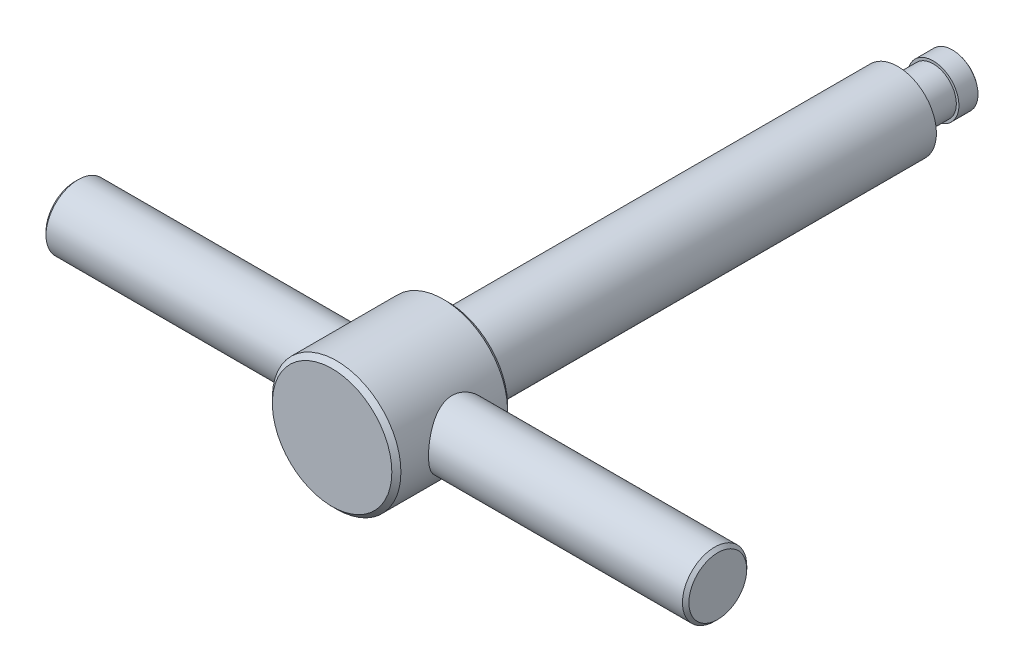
ISO-10303-21;
HEADER;
FILE_DESCRIPTION(('STEP AP214'),'2;1');
FILE_NAME('part.step','',(''),(''),'','','');
FILE_SCHEMA(('AUTOMOTIVE_DESIGN { 1 0 10303 214 1 1 1 1 }'));
ENDSEC;
DATA;
#1=APPLICATION_CONTEXT('core data for automotive mechanical design processes');
#2=APPLICATION_PROTOCOL_DEFINITION('international standard','automotive_design',2000,#1);
#3=PRODUCT_CONTEXT('',#1,'mechanical');
#4=PRODUCT('Part','Part','',(#3));
#5=PRODUCT_RELATED_PRODUCT_CATEGORY('part','',(#4));
#6=PRODUCT_DEFINITION_FORMATION('','',#4);
#7=PRODUCT_DEFINITION_CONTEXT('part definition',#1,'design');
#8=PRODUCT_DEFINITION('design','',#6,#7);
#9=PRODUCT_DEFINITION_SHAPE('','',#8);
#10=(LENGTH_UNIT() NAMED_UNIT(*) SI_UNIT(.MILLI.,.METRE.));
#11=(NAMED_UNIT(*) PLANE_ANGLE_UNIT() SI_UNIT($,.RADIAN.));
#12=(NAMED_UNIT(*) SI_UNIT($,.STERADIAN.) SOLID_ANGLE_UNIT());
#13=UNCERTAINTY_MEASURE_WITH_UNIT(LENGTH_MEASURE(1.E-05),#10,'distance_accuracy_value','');
#14=(GEOMETRIC_REPRESENTATION_CONTEXT(3) GLOBAL_UNCERTAINTY_ASSIGNED_CONTEXT((#13)) GLOBAL_UNIT_ASSIGNED_CONTEXT((#10,
#11,#12)) REPRESENTATION_CONTEXT('',''));
#15=CARTESIAN_POINT('',(0.,0.,0.));
#16=DIRECTION('',(0.,0.,1.));
#17=DIRECTION('',(1.,0.,0.));
#18=AXIS2_PLACEMENT_3D('',#15,#16,#17);
#19=CARTESIAN_POINT('',(50.,0.,92.5));
#20=DIRECTION('',(-1.,0.,0.));
#21=DIRECTION('',(0.,-1.,0.));
#22=AXIS2_PLACEMENT_3D('',#19,#20,#21);
#23=PLANE('',#22);
#24=CARTESIAN_POINT('',(50.0000000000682,0.,88.));
#25=DIRECTION('',(-1.,0.,0.));
#26=DIRECTION('',(0.,0.,-1.));
#27=AXIS2_PLACEMENT_3D('',#24,#25,#26);
#28=CIRCLE('',#27,4.49999999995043);
#29=CARTESIAN_POINT('',(50.0000000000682,0.,83.5000000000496));
#30=VERTEX_POINT('',#29);
#31=EDGE_CURVE('E15',#30,#30,#28,.T.);
#32=ORIENTED_EDGE('',*,*,#31,.F.);
#33=EDGE_LOOP('',(#32));
#34=FACE_BOUND('',#33,.T.);
#35=ADVANCED_FACE('F12',(#34),#23,.F.);
#36=CARTESIAN_POINT('',(-50.,0.,88.));
#37=DIRECTION('',(1.,0.,0.));
#38=DIRECTION('',(0.,1.,0.));
#39=AXIS2_PLACEMENT_3D('',#36,#37,#38);
#40=PLANE('',#39);
#41=CARTESIAN_POINT('',(-50.0000000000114,0.,88.));
#42=DIRECTION('',(1.,0.,0.));
#43=DIRECTION('',(0.,1.,0.));
#44=AXIS2_PLACEMENT_3D('',#41,#42,#43);
#45=CIRCLE('',#44,4.50000000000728);
#46=CARTESIAN_POINT('',(-50.0000000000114,4.50000000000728,88.));
#47=VERTEX_POINT('',#46);
#48=EDGE_CURVE('E133',#47,#47,#45,.T.);
#49=ORIENTED_EDGE('',*,*,#48,.F.);
#50=EDGE_LOOP('',(#49));
#51=FACE_BOUND('',#50,.T.);
#52=ADVANCED_FACE('F171',(#51),#40,.F.);
#53=CARTESIAN_POINT('',(0.,0.,6.));
#54=DIRECTION('',(-1.,0.,0.));
#55=DIRECTION('',(0.,1.,0.));
#56=AXIS2_PLACEMENT_3D('',#53,#54,#55);
#57=SPHERICAL_SURFACE('',#56,6.);
#58=CARTESIAN_POINT('',(0.,0.,1.52786404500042));
#59=DIRECTION('',(0.,0.,1.));
#60=DIRECTION('',(0.,-1.,0.));
#61=AXIS2_PLACEMENT_3D('',#58,#59,#60);
#62=CIRCLE('',#61,4.);
#63=CARTESIAN_POINT('',(0.,-4.,1.52786404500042));
#64=VERTEX_POINT('',#63);
#65=EDGE_CURVE('E126',#64,#64,#62,.T.);
#66=ORIENTED_EDGE('',*,*,#65,.F.);
#67=EDGE_LOOP('',(#66));
#68=FACE_BOUND('',#67,.T.);
#69=ADVANCED_FACE('F168',(#68),#57,.T.);
#70=CARTESIAN_POINT('',(49.5000000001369,0.,88.));
#71=DIRECTION('',(-1.,0.,0.));
#72=DIRECTION('',(0.,0.,-1.));
#73=AXIS2_PLACEMENT_3D('',#70,#71,#72);
#74=CONICAL_SURFACE('',#73,4.99999999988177,0.785398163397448);
#75=CARTESIAN_POINT('',(49.5,0.,88.));
#76=DIRECTION('',(-1.,0.,0.));
#77=DIRECTION('',(0.,-1.,0.));
#78=AXIS2_PLACEMENT_3D('',#75,#76,#77);
#79=CIRCLE('',#78,5.);
#80=CARTESIAN_POINT('',(49.5,-5.,88.));
#81=VERTEX_POINT('',#80);
#82=EDGE_CURVE('E124',#81,#81,#79,.T.);
#83=ORIENTED_EDGE('',*,*,#82,.F.);
#84=EDGE_LOOP('',(#83));
#85=FACE_BOUND('',#84,.T.);
#86=ORIENTED_EDGE('',*,*,#31,.T.);
#87=EDGE_LOOP('',(#86));
#88=FACE_BOUND('',#87,.T.);
#89=ADVANCED_FACE('F164',(#85,#88),#74,.T.);
#90=CARTESIAN_POINT('',(0.,0.,98.));
#91=DIRECTION('',(0.,0.,-1.));
#92=DIRECTION('',(0.,1.,0.));
#93=AXIS2_PLACEMENT_3D('',#90,#91,#92);
#94=PLANE('',#93);
#95=CARTESIAN_POINT('',(0.,0.,98.));
#96=DIRECTION('',(0.,0.,-1.));
#97=DIRECTION('',(1.,0.,0.));
#98=AXIS2_PLACEMENT_3D('',#95,#96,#97);
#99=CIRCLE('',#98,9.29289321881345);
#100=CARTESIAN_POINT('',(9.29289321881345,0.,98.));
#101=VERTEX_POINT('',#100);
#102=EDGE_CURVE('E121',#101,#101,#99,.T.);
#103=ORIENTED_EDGE('',*,*,#102,.F.);
#104=EDGE_LOOP('',(#103));
#105=FACE_BOUND('',#104,.T.);
#106=ADVANCED_FACE('F160',(#105),#94,.F.);
#107=CARTESIAN_POINT('',(-49.5000000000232,0.,88.));
#108=DIRECTION('',(1.,0.,0.));
#109=DIRECTION('',(0.,1.,0.));
#110=AXIS2_PLACEMENT_3D('',#107,#108,#109);
#111=CONICAL_SURFACE('',#110,4.99999999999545,0.785398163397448);
#112=ORIENTED_EDGE('',*,*,#48,.T.);
#113=EDGE_LOOP('',(#112));
#114=FACE_BOUND('',#113,.T.);
#115=CARTESIAN_POINT('',(-49.5,0.,88.));
#116=DIRECTION('',(-1.,0.,0.));
#117=DIRECTION('',(0.,-1.,0.));
#118=AXIS2_PLACEMENT_3D('',#115,#116,#117);
#119=CIRCLE('',#118,5.);
#120=CARTESIAN_POINT('',(-49.5,-5.,88.));
#121=VERTEX_POINT('',#120);
#122=EDGE_CURVE('E117',#121,#121,#119,.F.);
#123=ORIENTED_EDGE('',*,*,#122,.F.);
#124=EDGE_LOOP('',(#123));
#125=FACE_BOUND('',#124,.T.);
#126=ADVANCED_FACE('F154',(#114,#125),#111,.T.);
#127=CARTESIAN_POINT('',(0.,0.,0.));
#128=DIRECTION('',(0.,0.,1.));
#129=DIRECTION('',(0.,-1.,0.));
#130=AXIS2_PLACEMENT_3D('',#127,#128,#129);
#131=CYLINDRICAL_SURFACE('',#130,4.);
#132=CARTESIAN_POINT('',(0.,0.,4.5));
#133=DIRECTION('',(0.,0.,1.));
#134=DIRECTION('',(0.,-1.,0.));
#135=AXIS2_PLACEMENT_3D('',#132,#133,#134);
#136=CIRCLE('',#135,4.);
#137=CARTESIAN_POINT('',(0.,-4.,4.5));
#138=VERTEX_POINT('',#137);
#139=EDGE_CURVE('E120',#138,#138,#136,.F.);
#140=ORIENTED_EDGE('',*,*,#139,.T.);
#141=EDGE_LOOP('',(#140));
#142=FACE_BOUND('',#141,.T.);
#143=ORIENTED_EDGE('',*,*,#65,.T.);
#144=EDGE_LOOP('',(#143));
#145=FACE_BOUND('',#144,.T.);
#146=ADVANCED_FACE('F147',(#142,#145),#131,.T.);
#147=CARTESIAN_POINT('',(50.,0.,88.));
#148=DIRECTION('',(-1.,0.,0.));
#149=DIRECTION('',(0.,-1.,0.));
#150=AXIS2_PLACEMENT_3D('',#147,#148,#149);
#151=CYLINDRICAL_SURFACE('',#150,5.);
#152=CARTESIAN_POINT('',(8.6639413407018,4.9936079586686,87.7472559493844));
#153=CARTESIAN_POINT('',(8.6678034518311,4.98690821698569,87.6149033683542));
#154=CARTESIAN_POINT('',(8.6746945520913,4.97494418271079,87.4828866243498));
#155=CARTESIAN_POINT('',(8.69427133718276,4.94065080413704,87.2205887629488));
#156=CARTESIAN_POINT('',(8.70696013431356,4.91831589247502,87.090308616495));
#157=CARTESIAN_POINT('',(8.73768503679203,4.86352211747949,86.8322782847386));
#158=CARTESIAN_POINT('',(8.75573112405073,4.8310443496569,86.7045333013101));
#159=CARTESIAN_POINT('',(8.79651985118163,4.75636852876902,86.4526662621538));
#160=CARTESIAN_POINT('',(8.81926458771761,4.71416613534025,86.3285458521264));
#161=CARTESIAN_POINT('',(8.89313906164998,4.57418822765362,85.9643002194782));
#162=CARTESIAN_POINT('',(8.95014013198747,4.4626532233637,85.7304943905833));
#163=CARTESIAN_POINT('',(9.07337097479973,4.20643250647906,85.2848338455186));
#164=CARTESIAN_POINT('',(9.13960025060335,4.06174857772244,85.072977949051));
#165=CARTESIAN_POINT('',(9.28089281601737,3.72835184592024,84.6568680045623));
#166=CARTESIAN_POINT('',(9.35622221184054,3.53689559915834,84.4548979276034));
#167=CARTESIAN_POINT('',(9.50269094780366,3.12203782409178,84.0846325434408));
#168=CARTESIAN_POINT('',(9.57382865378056,2.89862395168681,83.9163503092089));
#169=CARTESIAN_POINT('',(9.67330415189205,2.53843331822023,83.6898233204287));
#170=CARTESIAN_POINT('',(9.7058122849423,2.41146244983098,83.6174994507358));
#171=CARTESIAN_POINT('',(9.7668501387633,2.15092926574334,83.4839286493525));
#172=CARTESIAN_POINT('',(9.79538157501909,2.01736982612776,83.4226769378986));
#173=CARTESIAN_POINT('',(9.84761864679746,1.74461665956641,83.3119327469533));
#174=CARTESIAN_POINT('',(9.87132625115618,1.60542525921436,83.2624354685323));
#175=CARTESIAN_POINT('',(9.91320308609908,1.32244067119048,83.1757863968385));
#176=CARTESIAN_POINT('',(9.9313729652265,1.17864802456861,83.1386331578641));
#177=CARTESIAN_POINT('',(9.96027993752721,0.900367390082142,83.0798607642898));
#178=CARTESIAN_POINT('',(9.97152591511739,0.766157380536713,83.0571718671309));
#179=CARTESIAN_POINT('',(9.98860845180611,0.495997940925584,83.022799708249));
#180=CARTESIAN_POINT('',(9.9944454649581,0.360048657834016,83.0111155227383));
#181=CARTESIAN_POINT('',(10.0005447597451,0.0875738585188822,82.9989077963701));
#182=CARTESIAN_POINT('',(10.0008090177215,-0.0489514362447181,82.9983802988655));
#183=CARTESIAN_POINT('',(9.99576016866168,-0.321481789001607,83.0084830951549));
#184=CARTESIAN_POINT('',(9.99044726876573,-0.45748686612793,83.0191129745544));
#185=CARTESIAN_POINT('',(9.97498362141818,-0.717956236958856,83.0502056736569));
#186=CARTESIAN_POINT('',(9.96521520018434,-0.842536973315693,83.0698923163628));
#187=CARTESIAN_POINT('',(9.94124846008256,-1.08948387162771,83.1185178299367));
#188=CARTESIAN_POINT('',(9.92704873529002,-1.21184931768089,83.1474596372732));
#189=CARTESIAN_POINT('',(9.89455126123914,-1.45351624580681,83.2142922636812));
#190=CARTESIAN_POINT('',(9.87625470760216,-1.57281861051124,83.2521804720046));
#191=CARTESIAN_POINT('',(9.83597398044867,-1.80771983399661,83.3365518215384));
#192=CARTESIAN_POINT('',(9.81398839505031,-1.92331725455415,83.3830382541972));
#193=CARTESIAN_POINT('',(9.74156802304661,-2.27136199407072,83.5382972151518));
#194=CARTESIAN_POINT('',(9.6858132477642,-2.49684688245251,83.6605947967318));
#195=CARTESIAN_POINT('',(9.56530778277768,-2.92480777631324,83.9366877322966));
#196=CARTESIAN_POINT('',(9.50055298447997,-3.12727319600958,84.0904974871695));
#197=CARTESIAN_POINT('',(9.36078921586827,-3.52480596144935,84.4428786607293));
#198=CARTESIAN_POINT('',(9.28540002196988,-3.7171514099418,84.6443755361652));
#199=CARTESIAN_POINT('',(9.13782606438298,-4.06646861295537,85.0774671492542));
#200=CARTESIAN_POINT('',(9.06564336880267,-4.22341779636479,85.3090809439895));
#201=CARTESIAN_POINT('',(8.96466251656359,-4.43183231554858,85.6804757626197));
#202=CARTESIAN_POINT('',(8.93163700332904,-4.49782747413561,85.8111425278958));
#203=CARTESIAN_POINT('',(8.86988749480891,-4.61840670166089,86.0785929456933));
#204=CARTESIAN_POINT('',(8.84116149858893,-4.67299608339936,86.2153737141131));
#205=CARTESIAN_POINT('',(8.78915478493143,-4.77009386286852,86.494025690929));
#206=CARTESIAN_POINT('',(8.76586925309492,-4.81261294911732,86.6358922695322));
#207=CARTESIAN_POINT('',(8.72571734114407,-4.88503616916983,86.9236976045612));
#208=CARTESIAN_POINT('',(8.70884993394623,-4.91494232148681,87.0696357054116));
#209=CARTESIAN_POINT('',(8.68367597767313,-4.95926907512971,87.3491683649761));
#210=CARTESIAN_POINT('',(8.67467052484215,-4.97496023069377,87.4824995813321));
#211=CARTESIAN_POINT('',(8.66282228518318,-4.99556348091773,87.7502606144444));
#212=CARTESIAN_POINT('',(8.65997890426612,-5.00047661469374,87.8846903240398));
#213=CARTESIAN_POINT('',(8.66057117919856,-4.99945062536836,88.1534566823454));
#214=CARTESIAN_POINT('',(8.66400516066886,-4.99351439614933,88.2877933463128));
#215=CARTESIAN_POINT('',(8.6770076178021,-4.97088602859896,88.5552512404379));
#216=CARTESIAN_POINT('',(8.68657590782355,-4.95419421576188,88.6883725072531));
#217=CARTESIAN_POINT('',(8.71036385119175,-4.91223841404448,88.9406294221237));
#218=CARTESIAN_POINT('',(8.72409695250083,-4.88786373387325,89.0599602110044));
#219=CARTESIAN_POINT('',(8.75590671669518,-4.83064807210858,89.2959957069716));
#220=CARTESIAN_POINT('',(8.77398472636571,-4.79780446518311,89.4126995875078));
#221=CARTESIAN_POINT('',(8.83395755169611,-4.68703534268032,89.7578390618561));
#222=CARTESIAN_POINT('',(8.88160721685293,-4.59684472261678,89.9814608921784));
#223=CARTESIAN_POINT('',(8.99125967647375,-4.37871621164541,90.4275802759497));
#224=CARTESIAN_POINT('',(9.05407323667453,-4.24844682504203,90.6487244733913));
#225=CARTESIAN_POINT('',(9.18532801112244,-3.95668828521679,91.0675468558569));
#226=CARTESIAN_POINT('',(9.25377257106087,-3.79518049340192,91.2652109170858));
#227=CARTESIAN_POINT('',(9.39832077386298,-3.42284387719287,91.6558446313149));
#228=CARTESIAN_POINT('',(9.47436862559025,-3.20843552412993,91.8454686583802));
#229=CARTESIAN_POINT('',(9.58193181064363,-2.86376988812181,92.1011420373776));
#230=CARTESIAN_POINT('',(9.61672131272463,-2.74495698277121,92.1816143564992));
#231=CARTESIAN_POINT('',(9.68322432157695,-2.50024068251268,92.3323683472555));
#232=CARTESIAN_POINT('',(9.71493926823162,-2.37434065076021,92.4026547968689));
#233=CARTESIAN_POINT('',(9.77437128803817,-2.11640250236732,92.5322892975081));
#234=CARTESIAN_POINT('',(9.80209494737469,-1.98437498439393,92.591655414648));
#235=CARTESIAN_POINT('',(9.85280649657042,-1.71492890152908,92.6989393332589));
#236=CARTESIAN_POINT('',(9.875796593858,-1.57751288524,92.7468624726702));
#237=CARTESIAN_POINT('',(9.91635831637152,-1.29835291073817,92.8306839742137));
#238=CARTESIAN_POINT('',(9.93393271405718,-1.15661120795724,92.8665884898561));
#239=CARTESIAN_POINT('',(9.96312961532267,-0.86994021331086,92.9259131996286));
#240=CARTESIAN_POINT('',(9.97475279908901,-0.725011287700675,92.949334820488));
#241=CARTESIAN_POINT('',(9.99083813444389,-0.447757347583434,92.9816683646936));
#242=CARTESIAN_POINT('',(9.99589570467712,-0.315606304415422,92.9917879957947));
#243=CARTESIAN_POINT('',(10.0007472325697,-0.0508240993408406,93.0014961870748));
#244=CARTESIAN_POINT('',(10.000541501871,0.0818070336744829,93.0010853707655));
#245=CARTESIAN_POINT('',(9.99487225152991,0.346478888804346,92.9897389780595));
#246=CARTESIAN_POINT('',(9.989409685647,0.478519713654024,92.9788053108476));
#247=CARTESIAN_POINT('',(9.97337445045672,0.741008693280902,92.9465536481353));
#248=CARTESIAN_POINT('',(9.962801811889,0.871456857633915,92.9252357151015));
#249=CARTESIAN_POINT('',(9.93743452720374,1.12369515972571,92.8737135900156));
#250=CARTESIAN_POINT('',(9.9228627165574,1.24560333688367,92.8439763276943));
#251=CARTESIAN_POINT('',(9.88966974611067,1.48634787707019,92.7756100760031));
#252=CARTESIAN_POINT('',(9.87104728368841,1.60518323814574,92.7369782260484));
#253=CARTESIAN_POINT('',(9.80970869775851,1.95595951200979,92.6082690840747));
#254=CARTESIAN_POINT('',(9.76150048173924,2.18236866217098,92.5053371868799));
#255=CARTESIAN_POINT('',(9.6512451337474,2.6286090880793,92.2613458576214));
#256=CARTESIAN_POINT('',(9.58853528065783,2.84720551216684,92.1183503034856));
#257=CARTESIAN_POINT('',(9.45668808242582,3.25848585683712,91.8012792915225));
#258=CARTESIAN_POINT('',(9.38754708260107,3.45115488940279,91.6271861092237));
#259=CARTESIAN_POINT('',(9.24208671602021,3.82463320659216,91.23310217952));
#260=CARTESIAN_POINT('',(9.1657245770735,4.00245580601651,91.0102916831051));
#261=CARTESIAN_POINT('',(9.02097056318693,4.31884937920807,90.5355067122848));
#262=CARTESIAN_POINT('',(8.95258327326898,4.45739783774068,90.2835156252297));
#263=CARTESIAN_POINT('',(8.86265475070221,4.63224192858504,89.8876796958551));
#264=CARTESIAN_POINT('',(8.83473366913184,4.68511709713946,89.7524000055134));
#265=CARTESIAN_POINT('',(8.78424027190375,4.77911859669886,89.4768789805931));
#266=CARTESIAN_POINT('',(8.76166504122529,4.82025133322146,89.336640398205));
#267=CARTESIAN_POINT('',(8.72286222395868,4.8901197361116,89.0526469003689));
#268=CARTESIAN_POINT('',(8.70661815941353,4.91888760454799,88.9089021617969));
#269=CARTESIAN_POINT('',(8.68114164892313,4.96371371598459,88.6189038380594));
#270=CARTESIAN_POINT('',(8.67190422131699,4.97978098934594,88.4726521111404));
#271=CARTESIAN_POINT('',(8.66276238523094,4.99565691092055,88.2296234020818));
#272=CARTESIAN_POINT('',(8.66073972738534,4.99915860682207,88.1331479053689));
#273=CARTESIAN_POINT('',(8.65992340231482,5.00057282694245,87.9401409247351));
#274=CARTESIAN_POINT('',(8.66112970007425,4.9984854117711,87.8436094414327));
#275=CARTESIAN_POINT('',(8.6639413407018,4.9936079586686,87.7472559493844));
#276=B_SPLINE_CURVE_WITH_KNOTS('',3,(#152,#153,#154,#155,#156,#157,#158,#159,#160,#161,#162,
#163,#164,#165,#166,#167,#168,#169,#170,#171,#172,#173,#174,#175,#176,#177,#178,#179,#180,#181,
#182,#183,#184,#185,#186,#187,#188,#189,#190,#191,#192,#193,#194,#195,#196,#197,#198,#199,#200,
#201,#202,#203,#204,#205,#206,#207,#208,#209,#210,#211,#212,#213,#214,#215,#216,#217,#218,#219,
#220,#221,#222,#223,#224,#225,#226,#227,#228,#229,#230,#231,#232,#233,#234,#235,#236,#237,#238,
#239,#240,#241,#242,#243,#244,#245,#246,#247,#248,#249,#250,#251,#252,#253,#254,#255,#256,#257,
#258,#259,#260,#261,#262,#263,#264,#265,#266,#267,#268,#269,#270,#271,#272,#273,#274,#275),
.UNSPECIFIED.,.T.,.F.,(4,2,2,2,2,2,2,2,2,2,2,2,2,2,2,2,2,2,2,2,2,2,2,2,2,2,2,2,2,2,2,2,2,2,2,2,
2,2,2,2,2,2,2,2,2,2,2,2,2,2,2,2,2,2,2,2,2,2,2,2,2,4),(0.,0.397631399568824,0.795476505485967,
1.19406759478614,1.59283693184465,2.38488811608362,3.17689668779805,4.03814904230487,
4.89973497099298,5.3483186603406,5.7967082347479,6.24491443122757,6.69306811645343,
7.10225762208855,7.51141277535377,7.92042282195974,8.32941767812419,8.70849392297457,
9.08769056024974,9.4667766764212,9.84600821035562,10.6299816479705,11.4143141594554,
12.2763801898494,13.1389943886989,13.5886788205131,14.0381533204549,14.4872285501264,
14.936231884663,15.3393329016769,15.7423950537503,16.1453497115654,16.5482921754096,
16.9155764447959,17.282974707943,18.017292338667,18.806919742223,19.5970197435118,
20.4809562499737,20.9234827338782,21.3658009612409,21.8073807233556,22.2487540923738,
22.6899011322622,23.1309977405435,23.5283898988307,23.9257585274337,24.3230550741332,
24.7203492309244,25.0988909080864,25.4775544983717,26.234278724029,27.0369665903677,
27.8401134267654,28.7215475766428,29.6034860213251,30.0466691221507,30.4896100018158,
30.9313902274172,31.3728560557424,31.6623372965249,31.9518153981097),.UNSPECIFIED.);
#277=CARTESIAN_POINT('',(8.6639413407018,4.9936079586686,87.7472559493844));
#278=VERTEX_POINT('',#277);
#279=EDGE_CURVE('E46',#278,#278,#276,.T.);
#280=ORIENTED_EDGE('',*,*,#279,.F.);
#281=EDGE_LOOP('',(#280));
#282=FACE_BOUND('',#281,.T.);
#283=ORIENTED_EDGE('',*,*,#82,.T.);
#284=EDGE_LOOP('',(#283));
#285=FACE_BOUND('',#284,.T.);
#286=ADVANCED_FACE('F145',(#282,#285),#151,.T.);
#287=CARTESIAN_POINT('',(0.,0.,97.2928932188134));
#288=DIRECTION('',(0.,0.,-1.));
#289=DIRECTION('',(1.,0.,0.));
#290=AXIS2_PLACEMENT_3D('',#287,#288,#289);
#291=CONICAL_SURFACE('',#290,10.,0.78539816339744);
#292=ORIENTED_EDGE('',*,*,#102,.T.);
#293=EDGE_LOOP('',(#292));
#294=FACE_BOUND('',#293,.T.);
#295=CARTESIAN_POINT('',(0.,0.,97.2928932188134));
#296=DIRECTION('',(0.,0.,1.));
#297=DIRECTION('',(0.,-1.,0.));
#298=AXIS2_PLACEMENT_3D('',#295,#296,#297);
#299=CIRCLE('',#298,10.);
#300=CARTESIAN_POINT('',(0.,-10.,97.2928932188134));
#301=VERTEX_POINT('',#300);
#302=EDGE_CURVE('E45',#301,#301,#299,.F.);
#303=ORIENTED_EDGE('',*,*,#302,.F.);
#304=EDGE_LOOP('',(#303));
#305=FACE_BOUND('',#304,.T.);
#306=ADVANCED_FACE('F72',(#294,#305),#291,.T.);
#307=CARTESIAN_POINT('',(50.,0.,88.));
#308=DIRECTION('',(-1.,0.,0.));
#309=DIRECTION('',(0.,-1.,0.));
#310=AXIS2_PLACEMENT_3D('',#307,#308,#309);
#311=CYLINDRICAL_SURFACE('',#310,5.);
#312=ORIENTED_EDGE('',*,*,#122,.T.);
#313=EDGE_LOOP('',(#312));
#314=FACE_BOUND('',#313,.T.);
#315=CARTESIAN_POINT('',(-8.6639413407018,4.99360795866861,88.2527440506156));
#316=CARTESIAN_POINT('',(-8.6678034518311,4.9869082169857,88.3850966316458));
#317=CARTESIAN_POINT('',(-8.6746945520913,4.97494418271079,88.5171133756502));
#318=CARTESIAN_POINT('',(-8.69427133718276,4.94065080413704,88.7794112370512));
#319=CARTESIAN_POINT('',(-8.70696013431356,4.91831589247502,88.909691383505));
#320=CARTESIAN_POINT('',(-8.73768503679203,4.86352211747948,89.1677217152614));
#321=CARTESIAN_POINT('',(-8.75573112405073,4.8310443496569,89.2954666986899));
#322=CARTESIAN_POINT('',(-8.79651985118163,4.75636852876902,89.5473337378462));
#323=CARTESIAN_POINT('',(-8.8192645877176,4.71416613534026,89.6714541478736));
#324=CARTESIAN_POINT('',(-8.89313906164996,4.57418822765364,90.0356997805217));
#325=CARTESIAN_POINT('',(-8.95014013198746,4.4626532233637,90.2695056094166));
#326=CARTESIAN_POINT('',(-9.07337097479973,4.20643250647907,90.7151661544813));
#327=CARTESIAN_POINT('',(-9.13960025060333,4.06174857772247,90.927022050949));
#328=CARTESIAN_POINT('',(-9.28089281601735,3.72835184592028,91.3431319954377));
#329=CARTESIAN_POINT('',(-9.35622221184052,3.53689559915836,91.5451020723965));
#330=CARTESIAN_POINT('',(-9.50269094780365,3.12203782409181,91.9153674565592));
#331=CARTESIAN_POINT('',(-9.57382865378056,2.89862395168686,92.0836496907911));
#332=CARTESIAN_POINT('',(-9.67330415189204,2.53843331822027,92.3101766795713));
#333=CARTESIAN_POINT('',(-9.7058122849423,2.41146244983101,92.3825005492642));
#334=CARTESIAN_POINT('',(-9.76685013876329,2.15092926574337,92.5160713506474));
#335=CARTESIAN_POINT('',(-9.79538157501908,2.0173698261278,92.5773230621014));
#336=CARTESIAN_POINT('',(-9.84761864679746,1.74461665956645,92.6880672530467));
#337=CARTESIAN_POINT('',(-9.87132625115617,1.60542525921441,92.7375645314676));
#338=CARTESIAN_POINT('',(-9.91320308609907,1.32244067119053,92.8242136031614));
#339=CARTESIAN_POINT('',(-9.9313729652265,1.17864802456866,92.8613668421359));
#340=CARTESIAN_POINT('',(-9.96027993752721,0.900367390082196,92.9201392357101));
#341=CARTESIAN_POINT('',(-9.97152591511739,0.766157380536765,92.942828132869));
#342=CARTESIAN_POINT('',(-9.9886084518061,0.49599794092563,92.977200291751));
#343=CARTESIAN_POINT('',(-9.9944454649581,0.360048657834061,92.9888844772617));
#344=CARTESIAN_POINT('',(-10.0005447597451,0.0875738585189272,93.0010922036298));
#345=CARTESIAN_POINT('',(-10.0008090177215,-0.0489514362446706,93.0016197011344));
#346=CARTESIAN_POINT('',(-9.99576016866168,-0.321481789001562,92.9915169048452));
#347=CARTESIAN_POINT('',(-9.99044726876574,-0.457486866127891,92.9808870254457));
#348=CARTESIAN_POINT('',(-9.97498362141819,-0.717956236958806,92.9497943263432));
#349=CARTESIAN_POINT('',(-9.96521520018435,-0.842536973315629,92.9301076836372));
#350=CARTESIAN_POINT('',(-9.94124846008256,-1.08948387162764,92.8814821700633));
#351=CARTESIAN_POINT('',(-9.92704873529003,-1.21184931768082,92.8525403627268));
#352=CARTESIAN_POINT('',(-9.89455126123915,-1.45351624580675,92.7857077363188));
#353=CARTESIAN_POINT('',(-9.87625470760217,-1.57281861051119,92.7478195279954));
#354=CARTESIAN_POINT('',(-9.83597398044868,-1.80771983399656,92.6634481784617));
#355=CARTESIAN_POINT('',(-9.81398839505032,-1.92331725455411,92.6169617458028));
#356=CARTESIAN_POINT('',(-9.74156802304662,-2.27136199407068,92.4617027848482));
#357=CARTESIAN_POINT('',(-9.6858132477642,-2.49684688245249,92.3394052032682));
#358=CARTESIAN_POINT('',(-9.56530778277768,-2.92480777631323,92.0633122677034));
#359=CARTESIAN_POINT('',(-9.50055298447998,-3.12727319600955,91.9095025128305));
#360=CARTESIAN_POINT('',(-9.36078921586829,-3.52480596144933,91.5571213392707));
#361=CARTESIAN_POINT('',(-9.28540002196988,-3.71715140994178,91.3556244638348));
#362=CARTESIAN_POINT('',(-9.13782606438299,-4.06646861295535,90.9225328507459));
#363=CARTESIAN_POINT('',(-9.06564336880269,-4.22341779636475,90.6909190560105));
#364=CARTESIAN_POINT('',(-8.96466251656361,-4.43183231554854,90.3195242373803));
#365=CARTESIAN_POINT('',(-8.93163700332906,-4.49782747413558,90.1888574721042));
#366=CARTESIAN_POINT('',(-8.86988749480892,-4.61840670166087,89.9214070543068));
#367=CARTESIAN_POINT('',(-8.84116149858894,-4.67299608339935,89.7846262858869));
#368=CARTESIAN_POINT('',(-8.78915478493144,-4.77009386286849,89.505974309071));
#369=CARTESIAN_POINT('',(-8.76586925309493,-4.81261294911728,89.3641077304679));
#370=CARTESIAN_POINT('',(-8.72571734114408,-4.88503616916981,89.0763023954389));
#371=CARTESIAN_POINT('',(-8.70884993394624,-4.91494232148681,88.9303642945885));
#372=CARTESIAN_POINT('',(-8.68367597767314,-4.95926907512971,88.650831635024));
#373=CARTESIAN_POINT('',(-8.67467052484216,-4.97496023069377,88.517500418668));
#374=CARTESIAN_POINT('',(-8.66282228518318,-4.99556348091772,88.2497393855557));
#375=CARTESIAN_POINT('',(-8.65997890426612,-5.00047661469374,88.1153096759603));
#376=CARTESIAN_POINT('',(-8.66057117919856,-4.99945062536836,87.8465433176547));
#377=CARTESIAN_POINT('',(-8.66400516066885,-4.99351439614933,87.7122066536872));
#378=CARTESIAN_POINT('',(-8.6770076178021,-4.97088602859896,87.4447487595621));
#379=CARTESIAN_POINT('',(-8.68657590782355,-4.95419421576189,87.3116274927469));
#380=CARTESIAN_POINT('',(-8.71036385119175,-4.91223841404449,87.0593705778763));
#381=CARTESIAN_POINT('',(-8.72409695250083,-4.88786373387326,86.9400397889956));
#382=CARTESIAN_POINT('',(-8.75590671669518,-4.83064807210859,86.7040042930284));
#383=CARTESIAN_POINT('',(-8.77398472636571,-4.79780446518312,86.5873004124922));
#384=CARTESIAN_POINT('',(-8.8339575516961,-4.68703534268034,86.2421609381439));
#385=CARTESIAN_POINT('',(-8.88160721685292,-4.59684472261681,86.0185391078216));
#386=CARTESIAN_POINT('',(-8.99125967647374,-4.37871621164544,85.5724197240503));
#387=CARTESIAN_POINT('',(-9.05407323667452,-4.24844682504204,85.3512755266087));
#388=CARTESIAN_POINT('',(-9.18532801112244,-3.9566882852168,84.9324531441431));
#389=CARTESIAN_POINT('',(-9.25377257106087,-3.79518049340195,84.7347890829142));
#390=CARTESIAN_POINT('',(-9.39832077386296,-3.42284387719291,84.3441553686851));
#391=CARTESIAN_POINT('',(-9.47436862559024,-3.20843552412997,84.1545313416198));
#392=CARTESIAN_POINT('',(-9.58193181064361,-2.86376988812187,83.8988579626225));
#393=CARTESIAN_POINT('',(-9.61672131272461,-2.74495698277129,83.8183856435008));
#394=CARTESIAN_POINT('',(-9.68322432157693,-2.50024068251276,83.6676316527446));
#395=CARTESIAN_POINT('',(-9.71493926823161,-2.37434065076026,83.5973452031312));
#396=CARTESIAN_POINT('',(-9.77437128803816,-2.11640250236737,83.467710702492));
#397=CARTESIAN_POINT('',(-9.80209494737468,-1.98437498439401,83.408344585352));
#398=CARTESIAN_POINT('',(-9.85280649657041,-1.71492890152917,83.3010606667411));
#399=CARTESIAN_POINT('',(-9.87579659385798,-1.57751288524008,83.2531375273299));
#400=CARTESIAN_POINT('',(-9.91635831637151,-1.29835291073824,83.1693160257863));
#401=CARTESIAN_POINT('',(-9.93393271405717,-1.15661120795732,83.1334115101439));
#402=CARTESIAN_POINT('',(-9.96312961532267,-0.869940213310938,83.0740868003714));
#403=CARTESIAN_POINT('',(-9.97475279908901,-0.725011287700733,83.0506651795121));
#404=CARTESIAN_POINT('',(-9.99083813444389,-0.447757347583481,83.0183316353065));
#405=CARTESIAN_POINT('',(-9.99589570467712,-0.315606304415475,83.0082120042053));
#406=CARTESIAN_POINT('',(-10.0007472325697,-0.0508240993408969,82.9985038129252));
#407=CARTESIAN_POINT('',(-10.000541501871,0.0818070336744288,82.9989146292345));
#408=CARTESIAN_POINT('',(-9.99487225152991,0.346478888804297,83.0102610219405));
#409=CARTESIAN_POINT('',(-9.989409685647,0.478519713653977,83.0211946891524));
#410=CARTESIAN_POINT('',(-9.97337445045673,0.741008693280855,83.0534463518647));
#411=CARTESIAN_POINT('',(-9.96280181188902,0.871456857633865,83.0747642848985));
#412=CARTESIAN_POINT('',(-9.93743452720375,1.12369515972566,83.1262864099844));
#413=CARTESIAN_POINT('',(-9.92286271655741,1.24560333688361,83.1560236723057));
#414=CARTESIAN_POINT('',(-9.88966974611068,1.48634787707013,83.2243899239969));
#415=CARTESIAN_POINT('',(-9.87104728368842,1.60518323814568,83.2630217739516));
#416=CARTESIAN_POINT('',(-9.80970869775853,1.95595951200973,83.3917309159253));
#417=CARTESIAN_POINT('',(-9.76150048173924,2.18236866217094,83.49466281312));
#418=CARTESIAN_POINT('',(-9.65124513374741,2.62860908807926,83.7386541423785));
#419=CARTESIAN_POINT('',(-9.58853528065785,2.84720551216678,83.8816496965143));
#420=CARTESIAN_POINT('',(-9.45668808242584,3.25848585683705,84.1987207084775));
#421=CARTESIAN_POINT('',(-9.38754708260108,3.45115488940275,84.3728138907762));
#422=CARTESIAN_POINT('',(-9.24208671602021,3.82463320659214,84.7668978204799));
#423=CARTESIAN_POINT('',(-9.16572457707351,4.00245580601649,84.9897083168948));
#424=CARTESIAN_POINT('',(-9.02097056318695,4.31884937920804,85.4644932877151));
#425=CARTESIAN_POINT('',(-8.952583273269,4.45739783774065,85.7164843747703));
#426=CARTESIAN_POINT('',(-8.86265475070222,4.63224192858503,86.1123203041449));
#427=CARTESIAN_POINT('',(-8.83473366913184,4.68511709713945,86.2475999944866));
#428=CARTESIAN_POINT('',(-8.78424027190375,4.77911859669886,86.5231210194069));
#429=CARTESIAN_POINT('',(-8.76166504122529,4.82025133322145,86.6633596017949));
#430=CARTESIAN_POINT('',(-8.72286222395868,4.89011973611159,86.947353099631));
#431=CARTESIAN_POINT('',(-8.70661815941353,4.91888760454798,87.091097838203));
#432=CARTESIAN_POINT('',(-8.68114164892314,4.96371371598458,87.3810961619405));
#433=CARTESIAN_POINT('',(-8.671904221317,4.97978098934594,87.5273478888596));
#434=CARTESIAN_POINT('',(-8.66276238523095,4.99565691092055,87.7703765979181));
#435=CARTESIAN_POINT('',(-8.66073972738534,4.99915860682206,87.866852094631));
#436=CARTESIAN_POINT('',(-8.65992340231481,5.00057282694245,88.0598590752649));
#437=CARTESIAN_POINT('',(-8.66112970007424,4.99848541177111,88.1563905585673));
#438=CARTESIAN_POINT('',(-8.6639413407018,4.99360795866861,88.2527440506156));
#439=B_SPLINE_CURVE_WITH_KNOTS('',3,(#315,#316,#317,#318,#319,#320,#321,#322,#323,#324,#325,
#326,#327,#328,#329,#330,#331,#332,#333,#334,#335,#336,#337,#338,#339,#340,#341,#342,#343,#344,
#345,#346,#347,#348,#349,#350,#351,#352,#353,#354,#355,#356,#357,#358,#359,#360,#361,#362,#363,
#364,#365,#366,#367,#368,#369,#370,#371,#372,#373,#374,#375,#376,#377,#378,#379,#380,#381,#382,
#383,#384,#385,#386,#387,#388,#389,#390,#391,#392,#393,#394,#395,#396,#397,#398,#399,#400,#401,
#402,#403,#404,#405,#406,#407,#408,#409,#410,#411,#412,#413,#414,#415,#416,#417,#418,#419,#420,
#421,#422,#423,#424,#425,#426,#427,#428,#429,#430,#431,#432,#433,#434,#435,#436,#437,#438),
.UNSPECIFIED.,.T.,.F.,(4,2,2,2,2,2,2,2,2,2,2,2,2,2,2,2,2,2,2,2,2,2,2,2,2,2,2,2,2,2,2,2,2,2,2,2,
2,2,2,2,2,2,2,2,2,2,2,2,2,2,2,2,2,2,2,2,2,2,2,2,2,4),(0.,0.397631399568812,0.795476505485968,
1.19406759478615,1.59283693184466,2.38488811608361,3.17689668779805,4.03814904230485,
4.89973497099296,5.34831866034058,5.79670823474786,6.24491443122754,6.69306811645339,
7.10225762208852,7.51141277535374,7.92042282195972,8.32941767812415,8.70849392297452,
9.08769056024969,9.46677667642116,9.84600821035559,10.6299816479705,11.4143141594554,
12.2763801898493,13.1389943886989,13.5886788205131,14.0381533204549,14.4872285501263,
14.9362318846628,15.3393329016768,15.7423950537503,16.1453497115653,16.5482921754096,
16.9155764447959,17.282974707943,18.017292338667,18.806919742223,19.5970197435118,
20.4809562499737,20.9234827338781,21.3658009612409,21.8073807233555,22.2487540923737,
22.6899011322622,23.1309977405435,23.5283898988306,23.9257585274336,24.3230550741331,
24.7203492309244,25.0988909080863,25.4775544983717,26.2342787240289,27.0369665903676,
27.8401134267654,28.7215475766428,29.6034860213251,30.0466691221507,30.4896100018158,
30.9313902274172,31.3728560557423,31.6623372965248,31.9518153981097),.UNSPECIFIED.);
#440=CARTESIAN_POINT('',(-8.6639413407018,4.99360795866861,88.2527440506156));
#441=VERTEX_POINT('',#440);
#442=EDGE_CURVE('E37',#441,#441,#439,.T.);
#443=ORIENTED_EDGE('',*,*,#442,.F.);
#444=EDGE_LOOP('',(#443));
#445=FACE_BOUND('',#444,.T.);
#446=ADVANCED_FACE('F52',(#314,#445),#311,.T.);
#447=CARTESIAN_POINT('',(3.6,0.,4.5));
#448=DIRECTION('',(0.,0.,-1.));
#449=DIRECTION('',(0.,1.,0.));
#450=AXIS2_PLACEMENT_3D('',#447,#448,#449);
#451=PLANE('',#450);
#452=CARTESIAN_POINT('',(0.,0.,4.5));
#453=DIRECTION('',(0.,0.,1.));
#454=DIRECTION('',(0.,-1.,0.));
#455=AXIS2_PLACEMENT_3D('',#452,#453,#454);
#456=CIRCLE('',#455,3.6);
#457=CARTESIAN_POINT('',(0.,-3.6,4.5));
#458=VERTEX_POINT('',#457);
#459=EDGE_CURVE('E33',#458,#458,#456,.T.);
#460=ORIENTED_EDGE('',*,*,#459,.F.);
#461=EDGE_LOOP('',(#460));
#462=FACE_BOUND('',#461,.T.);
#463=ORIENTED_EDGE('',*,*,#139,.F.);
#464=EDGE_LOOP('',(#463));
#465=FACE_BOUND('',#464,.T.);
#466=ADVANCED_FACE('F61',(#462,#465),#451,.F.);
#467=CARTESIAN_POINT('',(0.,0.,0.));
#468=DIRECTION('',(0.,0.,1.));
#469=DIRECTION('',(0.,-1.,0.));
#470=AXIS2_PLACEMENT_3D('',#467,#468,#469);
#471=CYLINDRICAL_SURFACE('',#470,10.);
#472=ORIENTED_EDGE('',*,*,#442,.T.);
#473=EDGE_LOOP('',(#472));
#474=FACE_BOUND('',#473,.T.);
#475=ORIENTED_EDGE('',*,*,#302,.T.);
#476=EDGE_LOOP('',(#475));
#477=FACE_BOUND('',#476,.T.);
#478=ORIENTED_EDGE('',*,*,#279,.T.);
#479=EDGE_LOOP('',(#478));
#480=FACE_BOUND('',#479,.T.);
#481=CARTESIAN_POINT('',(0.,0.,80.7071067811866));
#482=DIRECTION('',(0.,0.,1.));
#483=DIRECTION('',(0.,-1.,0.));
#484=AXIS2_PLACEMENT_3D('',#481,#482,#483);
#485=CIRCLE('',#484,10.);
#486=CARTESIAN_POINT('',(0.,-10.,80.7071067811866));
#487=VERTEX_POINT('',#486);
#488=EDGE_CURVE('E36',#487,#487,#485,.F.);
#489=ORIENTED_EDGE('',*,*,#488,.F.);
#490=EDGE_LOOP('',(#489));
#491=FACE_BOUND('',#490,.T.);
#492=ADVANCED_FACE('F56',(#474,#477,#480,#491),#471,.T.);
#493=CARTESIAN_POINT('',(0.,0.,0.));
#494=DIRECTION('',(0.,0.,1.));
#495=DIRECTION('',(0.,-1.,0.));
#496=AXIS2_PLACEMENT_3D('',#493,#494,#495);
#497=CYLINDRICAL_SURFACE('',#496,3.6);
#498=CARTESIAN_POINT('',(0.,0.,8.61435935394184));
#499=DIRECTION('',(0.,0.,1.));
#500=DIRECTION('',(0.,-1.,0.));
#501=AXIS2_PLACEMENT_3D('',#498,#499,#500);
#502=CIRCLE('',#501,3.59999999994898);
#503=CARTESIAN_POINT('',(0.,-3.59999999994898,8.61435935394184));
#504=VERTEX_POINT('',#503);
#505=EDGE_CURVE('E32',#504,#504,#502,.T.);
#506=ORIENTED_EDGE('',*,*,#505,.F.);
#507=EDGE_LOOP('',(#506));
#508=FACE_BOUND('',#507,.T.);
#509=ORIENTED_EDGE('',*,*,#459,.T.);
#510=EDGE_LOOP('',(#509));
#511=FACE_BOUND('',#510,.T.);
#512=ADVANCED_FACE('F60',(#508,#511),#497,.T.);
#513=CARTESIAN_POINT('',(0.,0.,80.7071067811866));
#514=DIRECTION('',(0.,0.,1.));
#515=DIRECTION('',(0.,-1.,0.));
#516=AXIS2_PLACEMENT_3D('',#513,#514,#515);
#517=CONICAL_SURFACE('',#516,10.,0.785398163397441);
#518=ORIENTED_EDGE('',*,*,#488,.T.);
#519=EDGE_LOOP('',(#518));
#520=FACE_BOUND('',#519,.T.);
#521=CARTESIAN_POINT('',(0.,0.,80.));
#522=DIRECTION('',(0.,0.,1.));
#523=DIRECTION('',(0.,-1.,0.));
#524=AXIS2_PLACEMENT_3D('',#521,#522,#523);
#525=CIRCLE('',#524,9.29289321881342);
#526=CARTESIAN_POINT('',(0.,-9.29289321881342,80.));
#527=VERTEX_POINT('',#526);
#528=EDGE_CURVE('E24',#527,#527,#525,.T.);
#529=ORIENTED_EDGE('',*,*,#528,.T.);
#530=EDGE_LOOP('',(#529));
#531=FACE_BOUND('',#530,.T.);
#532=ADVANCED_FACE('F90',(#520,#531),#517,.T.);
#533=CARTESIAN_POINT('',(0.,0.,9.99999999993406));
#534=DIRECTION('',(0.,0.,1.));
#535=DIRECTION('',(0.,-1.,0.));
#536=AXIS2_PLACEMENT_3D('',#533,#534,#535);
#537=CONICAL_SURFACE('',#536,5.99999999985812,1.04719755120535);
#538=CARTESIAN_POINT('',(0.,0.,10.));
#539=DIRECTION('',(0.,0.,1.));
#540=DIRECTION('',(0.,-1.,0.));
#541=AXIS2_PLACEMENT_3D('',#538,#539,#540);
#542=CIRCLE('',#541,6.);
#543=CARTESIAN_POINT('',(0.,-6.,10.));
#544=VERTEX_POINT('',#543);
#545=EDGE_CURVE('E19',#544,#544,#542,.T.);
#546=ORIENTED_EDGE('',*,*,#545,.F.);
#547=EDGE_LOOP('',(#546));
#548=FACE_BOUND('',#547,.T.);
#549=ORIENTED_EDGE('',*,*,#505,.T.);
#550=EDGE_LOOP('',(#549));
#551=FACE_BOUND('',#550,.T.);
#552=ADVANCED_FACE('F84',(#548,#551),#537,.T.);
#553=CARTESIAN_POINT('',(9.29289321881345,0.,80.));
#554=DIRECTION('',(0.,0.,1.));
#555=DIRECTION('',(0.,-1.,0.));
#556=AXIS2_PLACEMENT_3D('',#553,#554,#555);
#557=PLANE('',#556);
#558=ORIENTED_EDGE('',*,*,#528,.F.);
#559=EDGE_LOOP('',(#558));
#560=FACE_BOUND('',#559,.T.);
#561=CARTESIAN_POINT('',(0.,0.,80.));
#562=DIRECTION('',(0.,0.,1.));
#563=DIRECTION('',(0.,-1.,0.));
#564=AXIS2_PLACEMENT_3D('',#561,#562,#563);
#565=CIRCLE('',#564,6.);
#566=CARTESIAN_POINT('',(0.,-6.,80.));
#567=VERTEX_POINT('',#566);
#568=EDGE_CURVE('E8',#567,#567,#565,.F.);
#569=ORIENTED_EDGE('',*,*,#568,.F.);
#570=EDGE_LOOP('',(#569));
#571=FACE_BOUND('',#570,.T.);
#572=ADVANCED_FACE('F78',(#560,#571),#557,.F.);
#573=CARTESIAN_POINT('',(0.,0.,0.));
#574=DIRECTION('',(0.,0.,1.));
#575=DIRECTION('',(0.,-1.,0.));
#576=AXIS2_PLACEMENT_3D('',#573,#574,#575);
#577=CYLINDRICAL_SURFACE('',#576,6.);
#578=ORIENTED_EDGE('',*,*,#568,.T.);
#579=EDGE_LOOP('',(#578));
#580=FACE_BOUND('',#579,.T.);
#581=ORIENTED_EDGE('',*,*,#545,.T.);
#582=EDGE_LOOP('',(#581));
#583=FACE_BOUND('',#582,.T.);
#584=ADVANCED_FACE('F76',(#580,#583),#577,.T.);
#585=CLOSED_SHELL('',(#35,#52,#69,#89,#106,#126,#146,#286,#306,#446,#466,#492,#512,#532,#552,
#572,#584));
#586=MANIFOLD_SOLID_BREP('B1',#585);
#587=ADVANCED_BREP_SHAPE_REPRESENTATION('',(#18,#586),#14);
#588=SHAPE_DEFINITION_REPRESENTATION(#9,#587);
ENDSEC;
END-ISO-10303-21;
